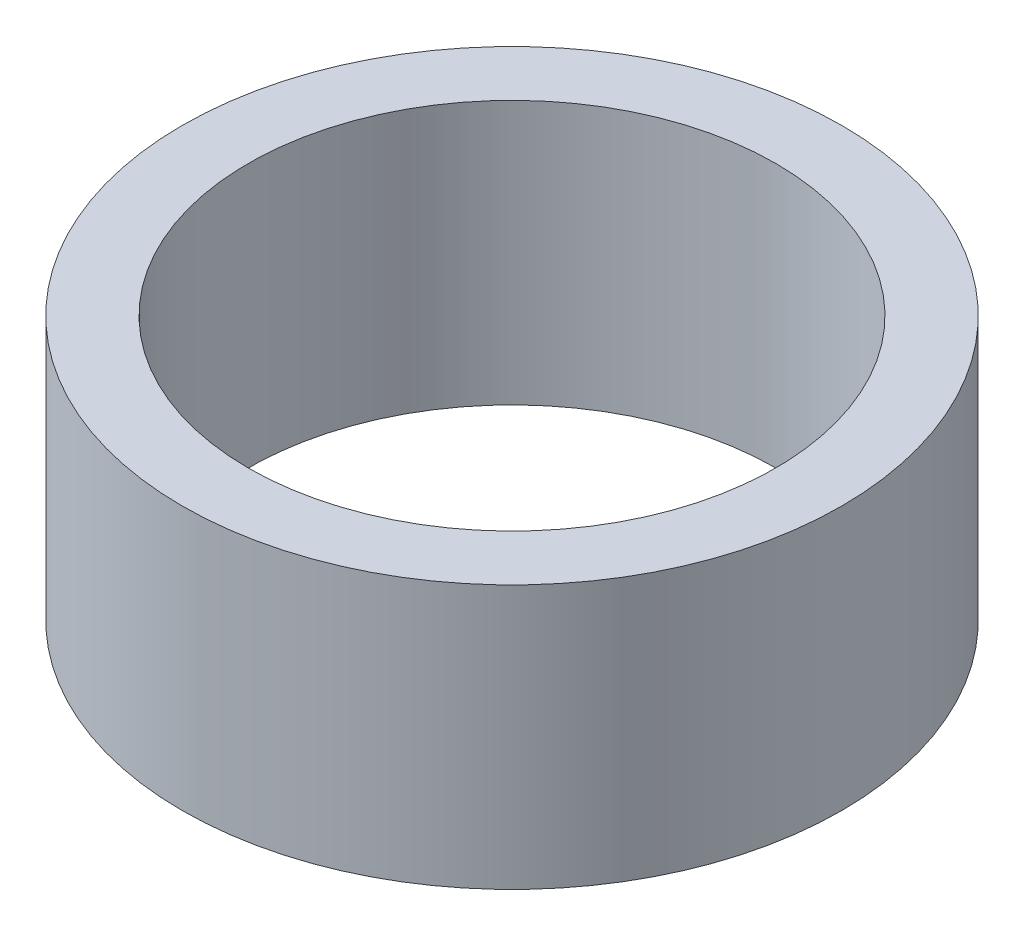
ISO-10303-21;
HEADER;
FILE_DESCRIPTION(('STEP AP214'),'2;1');
FILE_NAME('part.step','',(''),(''),'','','');
FILE_SCHEMA(('AUTOMOTIVE_DESIGN { 1 0 10303 214 1 1 1 1 }'));
ENDSEC;
DATA;
#1=APPLICATION_CONTEXT('core data for automotive mechanical design processes');
#2=APPLICATION_PROTOCOL_DEFINITION('international standard','automotive_design',2000,#1);
#3=PRODUCT_CONTEXT('',#1,'mechanical');
#4=PRODUCT('Part','Part','',(#3));
#5=PRODUCT_RELATED_PRODUCT_CATEGORY('part','',(#4));
#6=PRODUCT_DEFINITION_FORMATION('','',#4);
#7=PRODUCT_DEFINITION_CONTEXT('part definition',#1,'design');
#8=PRODUCT_DEFINITION('design','',#6,#7);
#9=PRODUCT_DEFINITION_SHAPE('','',#8);
#10=(LENGTH_UNIT() NAMED_UNIT(*) SI_UNIT(.MILLI.,.METRE.));
#11=(NAMED_UNIT(*) PLANE_ANGLE_UNIT() SI_UNIT($,.RADIAN.));
#12=(NAMED_UNIT(*) SI_UNIT($,.STERADIAN.) SOLID_ANGLE_UNIT());
#13=UNCERTAINTY_MEASURE_WITH_UNIT(LENGTH_MEASURE(1.E-05),#10,'distance_accuracy_value','');
#14=(GEOMETRIC_REPRESENTATION_CONTEXT(3) GLOBAL_UNCERTAINTY_ASSIGNED_CONTEXT((#13)) GLOBAL_UNIT_ASSIGNED_CONTEXT((#10,
#11,#12)) REPRESENTATION_CONTEXT('',''));
#15=CARTESIAN_POINT('',(0.,0.,0.));
#16=DIRECTION('',(0.,0.,1.));
#17=DIRECTION('',(1.,0.,0.));
#18=AXIS2_PLACEMENT_3D('',#15,#16,#17);
#19=CARTESIAN_POINT('',(0.,10.,0.));
#20=DIRECTION('',(0.,1.,0.));
#21=DIRECTION('',(0.,0.,1.));
#22=AXIS2_PLACEMENT_3D('',#19,#20,#21);
#23=PLANE('',#22);
#24=CARTESIAN_POINT('',(0.,10.,0.));
#25=DIRECTION('',(0.,1.,0.));
#26=DIRECTION('',(0.,0.,1.));
#27=AXIS2_PLACEMENT_3D('',#24,#25,#26);
#28=CIRCLE('',#27,12.5);
#29=CARTESIAN_POINT('',(0.,10.,12.5));
#30=VERTEX_POINT('',#29);
#31=EDGE_CURVE('E10',#30,#30,#28,.T.);
#32=ORIENTED_EDGE('',*,*,#31,.T.);
#33=EDGE_LOOP('',(#32));
#34=FACE_BOUND('',#33,.T.);
#35=CARTESIAN_POINT('',(0.,10.,0.));
#36=DIRECTION('',(0.,1.,0.));
#37=DIRECTION('',(0.,0.,1.));
#38=AXIS2_PLACEMENT_3D('',#35,#36,#37);
#39=CIRCLE('',#38,10.);
#40=CARTESIAN_POINT('',(0.,10.,10.));
#41=VERTEX_POINT('',#40);
#42=EDGE_CURVE('E41',#41,#41,#39,.T.);
#43=ORIENTED_EDGE('',*,*,#42,.F.);
#44=EDGE_LOOP('',(#43));
#45=FACE_BOUND('',#44,.T.);
#46=ADVANCED_FACE('F30',(#34,#45),#23,.T.);
#47=CARTESIAN_POINT('',(0.,0.,0.));
#48=DIRECTION('',(0.,1.,0.));
#49=DIRECTION('',(0.,0.,1.));
#50=AXIS2_PLACEMENT_3D('',#47,#48,#49);
#51=PLANE('',#50);
#52=CARTESIAN_POINT('',(0.,0.,0.));
#53=DIRECTION('',(0.,1.,0.));
#54=DIRECTION('',(0.,0.,1.));
#55=AXIS2_PLACEMENT_3D('',#52,#53,#54);
#56=CIRCLE('',#55,12.5);
#57=CARTESIAN_POINT('',(0.,0.,12.5));
#58=VERTEX_POINT('',#57);
#59=EDGE_CURVE('E34',#58,#58,#56,.T.);
#60=ORIENTED_EDGE('',*,*,#59,.F.);
#61=EDGE_LOOP('',(#60));
#62=FACE_BOUND('',#61,.T.);
#63=CARTESIAN_POINT('',(0.,0.,0.));
#64=DIRECTION('',(0.,1.,0.));
#65=DIRECTION('',(0.,0.,1.));
#66=AXIS2_PLACEMENT_3D('',#63,#64,#65);
#67=CIRCLE('',#66,10.);
#68=CARTESIAN_POINT('',(0.,0.,10.));
#69=VERTEX_POINT('',#68);
#70=EDGE_CURVE('E43',#69,#69,#67,.T.);
#71=ORIENTED_EDGE('',*,*,#70,.T.);
#72=EDGE_LOOP('',(#71));
#73=FACE_BOUND('',#72,.T.);
#74=ADVANCED_FACE('F53',(#62,#73),#51,.F.);
#75=CARTESIAN_POINT('',(0.,10.,0.));
#76=DIRECTION('',(0.,-1.,0.));
#77=DIRECTION('',(0.,0.,-1.));
#78=AXIS2_PLACEMENT_3D('',#75,#76,#77);
#79=CYLINDRICAL_SURFACE('',#78,12.5);
#80=ORIENTED_EDGE('',*,*,#31,.F.);
#81=EDGE_LOOP('',(#80));
#82=FACE_BOUND('',#81,.T.);
#83=ORIENTED_EDGE('',*,*,#59,.T.);
#84=EDGE_LOOP('',(#83));
#85=FACE_BOUND('',#84,.T.);
#86=ADVANCED_FACE('F32',(#82,#85),#79,.T.);
#87=CARTESIAN_POINT('',(0.,10.,0.));
#88=DIRECTION('',(0.,-1.,0.));
#89=DIRECTION('',(0.,0.,-1.));
#90=AXIS2_PLACEMENT_3D('',#87,#88,#89);
#91=CYLINDRICAL_SURFACE('',#90,10.);
#92=ORIENTED_EDGE('',*,*,#42,.T.);
#93=EDGE_LOOP('',(#92));
#94=FACE_BOUND('',#93,.T.);
#95=ORIENTED_EDGE('',*,*,#70,.F.);
#96=EDGE_LOOP('',(#95));
#97=FACE_BOUND('',#96,.T.);
#98=ADVANCED_FACE('F49',(#94,#97),#91,.F.);
#99=CLOSED_SHELL('',(#46,#74,#86,#98));
#100=MANIFOLD_SOLID_BREP('B2',#99);
#101=ADVANCED_BREP_SHAPE_REPRESENTATION('',(#18,#100),#14);
#102=SHAPE_DEFINITION_REPRESENTATION(#9,#101);
ENDSEC;
END-ISO-10303-21;
